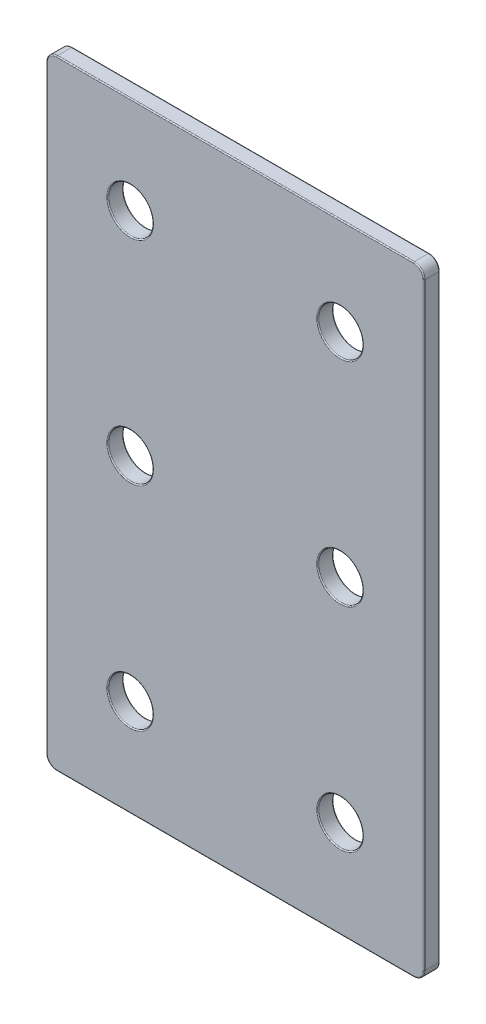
from build123d import *

# Parameters (mm, degrees)
SKETCH_1_W          = 72
SKETCH_1_H          = 118
EXTRUDE_1_DEPTH     = 1.5
SKETCH_2_R          = 4.25
CUT_EXTRUDE_1_DEPTH = 3
FILLET_1_R          = 2
FILLET_2_R          = 0.2


with BuildPart() as part:
    # Sketch 1 → Extrude 1 (new, symmetric)
    with BuildSketch(Plane.XY):
        Rectangle(SKETCH_1_W, SKETCH_1_H)
    extrude(amount=EXTRUDE_1_DEPTH, both=True)

    # Sketch 2 → Cut-Extrude 1 (cut)
    with BuildSketch(Plane.XY.offset(1.5)):
        with Locations((20, 0)):
            Circle(SKETCH_2_R)
        with Locations((20, 40.5)):
            Circle(SKETCH_2_R)
        with Locations(Location((20, -40.5, 0), (0, 0, 180))):
            Circle(SKETCH_2_R)
        with Locations((-20, -40.5)):
            Circle(SKETCH_2_R)
        with Locations(Location((-20, 0, 0), (0, 0, 180))):
            Circle(SKETCH_2_R)
        with Locations(Location((-20, 40.5, 0), (0, 0, 180))):
            Circle(SKETCH_2_R)
    extrude(amount=-CUT_EXTRUDE_1_DEPTH, mode=Mode.SUBTRACT)

    # Fillet 1
    fillet_1_edges = [part.edges().sort_by_distance(p)[0] for p in [
        (36, -59, 0),
        (-36, -59, 0),
        (-36, 59, 0),
        (36, 59, 0),
    ]]
    fillet(fillet_1_edges, radius=FILLET_1_R)

    # Fillet 2
    fillet_2_edges = [part.edges().sort_by_distance(p)[0] for p in [
        (15.75, 0, -1.5),
        (15.75, 0, 1.5),
        (15.75, 40.5, -1.5),
        (15.75, 40.5, 1.5),
        (24.25, -40.5, -1.5),
        (24.25, -40.5, 1.5),
        (-24.25, -40.5, -1.5),
        (-24.25, -40.5, 1.5),
        (-15.75, 0, -1.5),
        (-15.75, 0, 1.5),
        (-15.75, 40.5, -1.5),
        (-15.75, 40.5, 1.5),
        (0, -59, -1.5),
        (0, -59, 1.5),
        (36, 0, -1.5),
        (-36, 0, -1.5),
        (0, 59, -1.5),
        (35.414213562, 58.414213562, -1.5),
        (-35.414213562, 58.414213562, -1.5),
        (35.414213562, -58.414213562, -1.5),
        (-35.414213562, -58.414213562, -1.5),
        (-36, 0, 1.5),
        (36, 0, 1.5),
        (0, 59, 1.5),
        (35.414213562, 58.414213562, 1.5),
        (-35.414213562, 58.414213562, 1.5),
        (35.414213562, -58.414213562, 1.5),
        (-35.414213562, -58.414213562, 1.5),
    ]]
    fillet(fillet_2_edges, radius=FILLET_2_R)


solid = part.part
